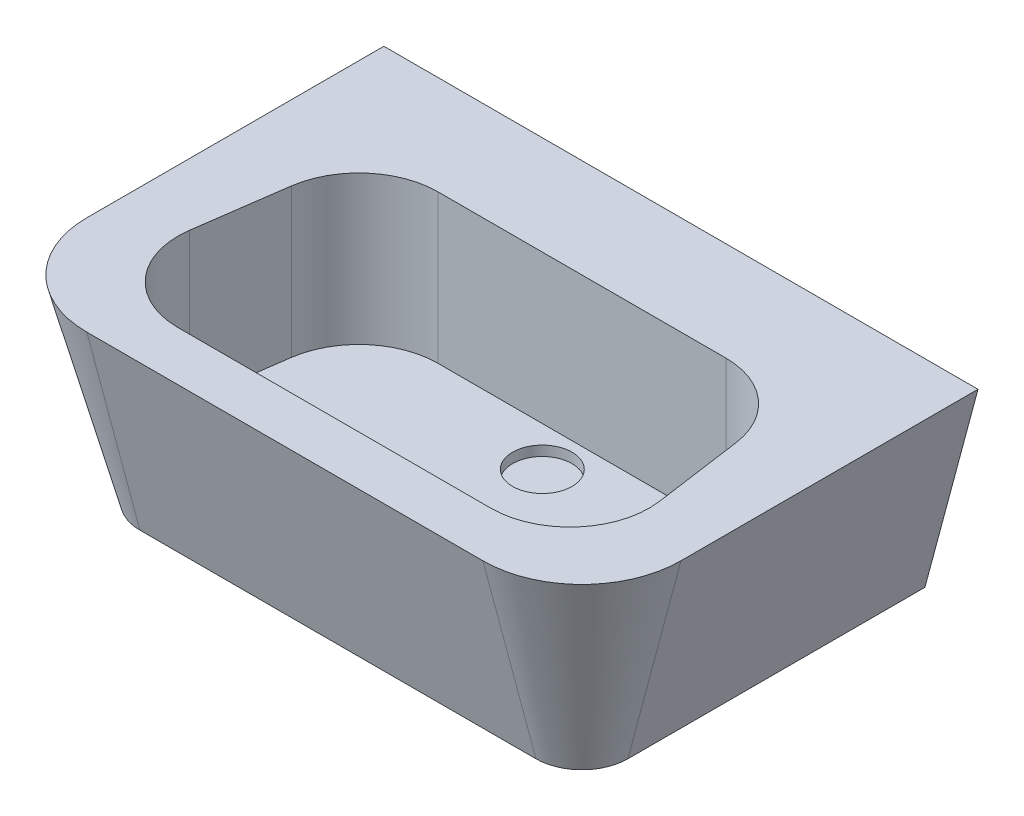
from build123d import *

# Parameters (mm, degrees)
ESQUISSE1_W             = 600
ESQUISSE1_H             = 400
BOSS_EXTRU_1_DEPTH      = 200
CONG_1_R                = 100
ENL_V_MAT_EXTRU_1_DEPTH = 150
CONG_2_R                = 80
ESQUISSE3_R             = 30
ENL_V_MAT_EXTRU_2_DEPTH = 10
D_POUILLE1_ANGLE        = -15


with BuildPart() as part:
    # Esquisse1 → Boss.-Extru.1 (new body)
    with BuildSketch(Plane(origin=(0, 0, 0), x_dir=(1, 0, 0), z_dir=(0, 1, 0))):
        with Locations((300, 200)):
            Rectangle(ESQUISSE1_W, ESQUISSE1_H)
    extrude(amount=BOSS_EXTRU_1_DEPTH)

    # Cong_1
    cong_1_edges = [part.edges().sort_by_distance(p)[0] for p in [
        (600, 100, 0),
        (0, 100, 0),
    ]]
    fillet(cong_1_edges, radius=CONG_1_R)

    # Esquisse2 → Enl_v. mat.-Extru.1 (cut)
    with BuildSketch(Plane(origin=(0, 200, 0), x_dir=(1, 0, 0), z_dir=(0, 1, 0))):
        Polygon((85.135208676, 300), (514.864791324, 300), (550, 50), (50, 50), align=None)
    extrude(amount=-ENL_V_MAT_EXTRU_1_DEPTH, mode=Mode.SUBTRACT)

    # Cong_2
    cong_2_edges = [part.edges().sort_by_distance(p)[0] for p in [
        (514.864791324, 125, -300),
        (550, 125, -50),
        (50, 125, -50),
        (85.135208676, 125, -300),
    ]]
    fillet(cong_2_edges, radius=CONG_2_R)

    # Esquisse3 → Enl_v. mat.-Extru.2 (cut)
    with BuildSketch(Plane(origin=(0, 50, 0), x_dir=(1, 0, 0), z_dir=(0, 1, 0))):
        with Locations(Location((300, 260, 0), (0, 0, 270))):
            Circle(ESQUISSE3_R)
    extrude(amount=-ENL_V_MAT_EXTRU_2_DEPTH, mode=Mode.SUBTRACT)

    # D_pouille1
    d_pouille1_faces = [part.faces().sort_by_distance(p)[0] for p in [
        (0, 100, -250),
        (600, 100, -250),
        (570.710678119, 100, -29.289321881),
        (29.289321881, 100, -29.289321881),
        (300, 100, 0),
    ]]
    draft(d_pouille1_faces, Plane.ZX.offset(200), D_POUILLE1_ANGLE)


solid = part.part
